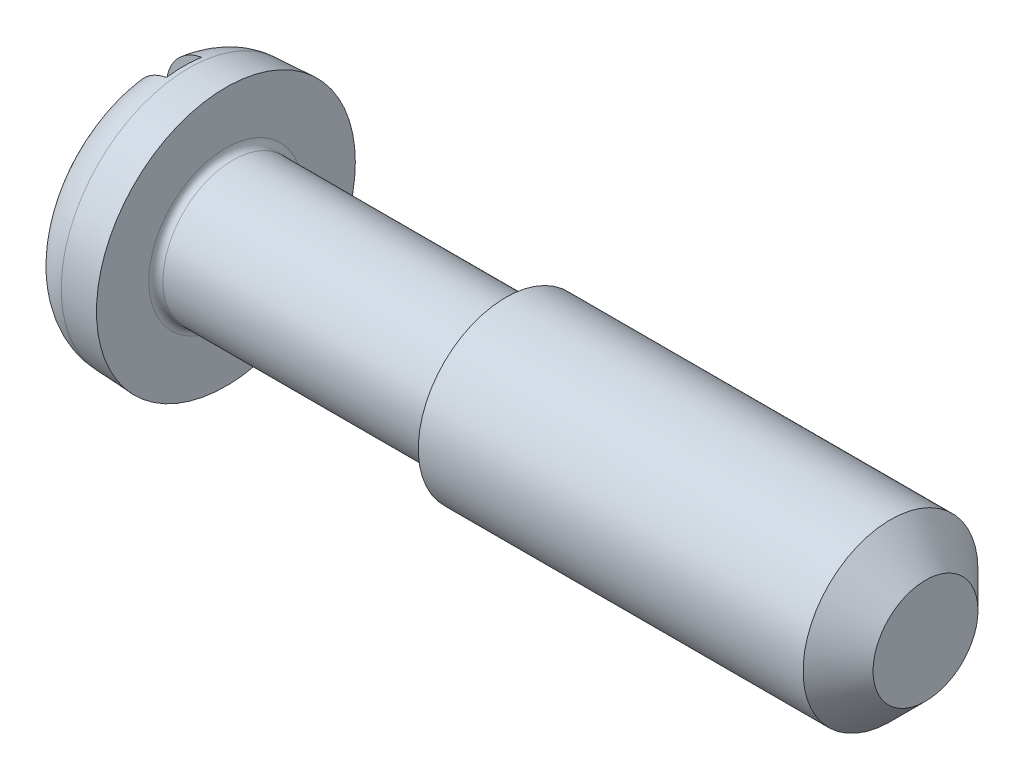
from build123d import *

# Parameters (mm, degrees)
SKETCH1_R       = 1.85
BASEHEAD_DEPTH  = 1.1
BASEHEAD_DRAFT  = -3
SKETCH2_R       = 1
BASEBODY_DEPTH  = 10
HEADFILLET_R    = 0.6
SLOT_DEPTH      = 13.390117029
SLOT_DEPTH_BACK = 13.390117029
SKETCH3_W       = 0.5
SKETCH3_H       = 0.5
SKETCH4_R       = 1.25
BASEEND_DEPTH   = 6
CHAMFER1_SIZE   = 0.5
FILLET1_R       = 0.1


with BuildPart() as part:
    # Sketch1 → BaseHead (with draft: the straight prism first)
    with BuildSketch(Plane(origin=(1.1, 0, 0), x_dir=(0, 0, -1), z_dir=(1, 0, 0))):
        Circle(SKETCH1_R)
    extrude(amount=-BASEHEAD_DEPTH)
    # BaseHead: the draft: its side faces are tilted about the plane it starts from
    basehead_sides = [part.faces().sort_by_distance(p)[0] for p in [
        (0.55, 0, 1.85),
    ]]
    draft(basehead_sides, Plane(origin=(1.1, 0, 0), x_dir=(0, 0, -1), z_dir=(1, 0, 0)), BASEHEAD_DRAFT)

    # Sketch2 → BaseBody (add)
    with BuildSketch(Plane(origin=(1.1, 0.224548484, -0.160278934), x_dir=(0, 0, -1), z_dir=(1, 0, 0))):
        with Locations((-0.160278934, -0.224548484)):
            Circle(SKETCH2_R)
    extrude(amount=BASEBODY_DEPTH)

    # HeadFillet
    headfillet_edges = [part.edges().sort_by_distance(p)[0] for p in [
        (0, 0, 1.792351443),
    ]]
    fillet(headfillet_edges, radius=HEADFILLET_R)

    # Sketch3 → Slot (cut, two sides: drawn at the far end of the back side and taken through both)
    with BuildSketch(Plane(origin=(-0.85, 0, 0.85), x_dir=(0, 0, -1), z_dir=(0, 1, 0)).offset(-SLOT_DEPTH_BACK)):
        with Locations((0.85, -1.1)):
            Rectangle(SKETCH3_W, SKETCH3_H)
    extrude(amount=SLOT_DEPTH + SLOT_DEPTH_BACK, mode=Mode.SUBTRACT)

    # Sketch4 → BaseEnd (add)
    with BuildSketch(Plane(origin=(11.1, -0.157111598, -0.758110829), x_dir=(0, 0, -1), z_dir=(1, 0, 0))):
        with Locations((-0.758110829, 0.157111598)):
            Circle(SKETCH4_R)
    extrude(amount=-BASEEND_DEPTH)

    # Chamfer1
    chamfer1_edges = [part.edges().sort_by_distance(p)[0] for p in [
        (11.1, 0, 1.25),
    ]]
    chamfer(chamfer1_edges, length=CHAMFER1_SIZE)

    # Fillet1
    fillet1_edges = [part.edges().sort_by_distance(p)[0] for p in [
        (5.1, 0, 1),
        (1.1, 0, 1),
    ]]
    fillet(fillet1_edges, radius=FILLET1_R)


solid = part.part
